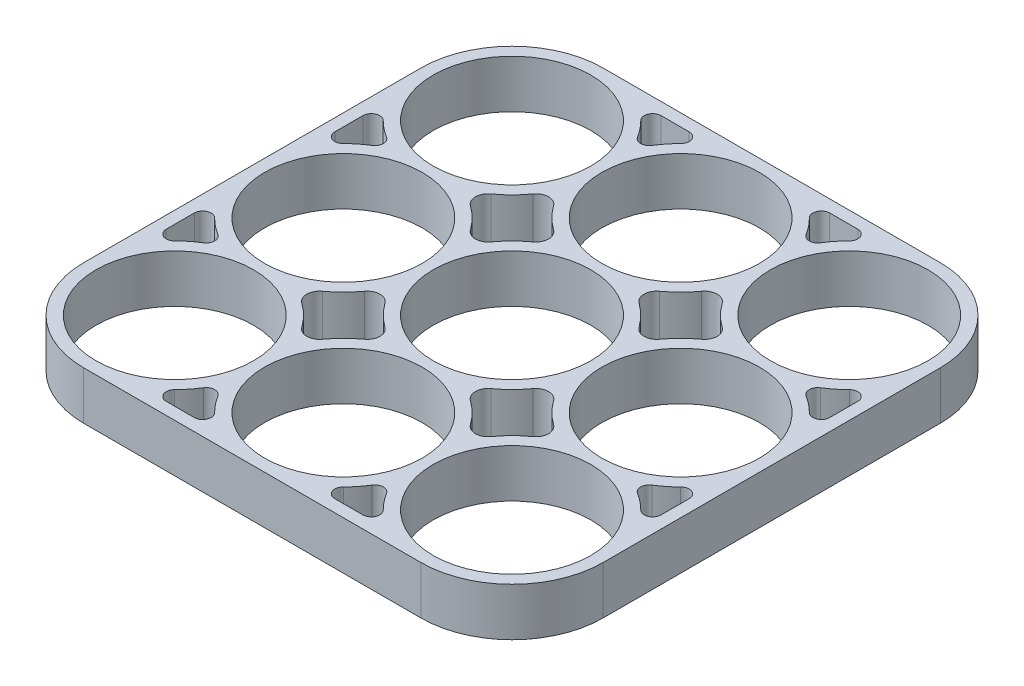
from build123d import *

# Parameters (mm, degrees)
SKIZZE1_R                       = 9.35
AUFSATZ_LINEAR_AUSTRAGEN1_DEPTH = 5.7


with BuildPart() as part:
    # Skizze1 → Aufsatz-Linear austragen1 (new body)
    with BuildSketch(Plane(origin=(0, 0, 0), x_dir=(1, 0, 0), z_dir=(0, 1, 0))):
        with BuildLine():
            Line((-30.8, 20), (-30.8, -20))
            ThreePointArc((-30.8, -20), (-27.636753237, -27.636753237), (-20, -30.8))
            Line((-20, -30.8), (20, -30.8))
            ThreePointArc((20, -30.8), (27.636753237, -27.636753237), (30.8, -20))
            Line((30.8, -20), (30.8, 20))
            ThreePointArc((30.8, 20), (27.636753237, 27.636753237), (20, 30.8))
            Line((20, 30.8), (-20, 30.8))
            ThreePointArc((-20, 30.8), (-27.636753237, 27.636753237), (-30.8, 20))
        make_face()
        with Locations(Location((-20, 20, 0), (0, 0, 270))):
            Circle(SKIZZE1_R, mode=Mode.SUBTRACT)
        with Locations(Location((-20, 0, 0), (0, 0, 270))):
            Circle(SKIZZE1_R, mode=Mode.SUBTRACT)
        with Locations(Location((-20, -20, 0), (0, 0, 270))):
            Circle(SKIZZE1_R, mode=Mode.SUBTRACT)
        with Locations(Location((0, -20, 0), (0, 0, 270))):
            Circle(SKIZZE1_R, mode=Mode.SUBTRACT)
        with Locations(Location((0, 0, 0), (0, 0, 270))):
            Circle(SKIZZE1_R, mode=Mode.SUBTRACT)
        with Locations(Location((0, 20, 0), (0, 0, 270))):
            Circle(SKIZZE1_R, mode=Mode.SUBTRACT)
        with Locations(Location((20, 20, 0), (0, 0, 270))):
            Circle(SKIZZE1_R, mode=Mode.SUBTRACT)
        with Locations(Location((20, 0, 0), (0, 0, 270))):
            Circle(SKIZZE1_R, mode=Mode.SUBTRACT)
        with Locations(Location((20, -20, 0), (0, 0, 270))):
            Circle(SKIZZE1_R, mode=Mode.SUBTRACT)
        with BuildLine():
            Line((-29.35, 11.662284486), (-29.35, 8.337715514))
            ThreePointArc((-29.35, 8.337715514), (-28.732343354, 7.41369519), (-27.642372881, 7.631129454))
            ThreePointArc((-27.642372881, 7.631129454), (-26.730970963, 8.445947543), (-25.733320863, 9.152542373))
            ThreePointArc((-25.733320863, 9.152542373), (-25.264183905, 10), (-25.733320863, 10.847457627))
            ThreePointArc((-25.733320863, 10.847457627), (-26.730970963, 11.554052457), (-27.642372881, 12.368870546))
            ThreePointArc((-27.642372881, 12.368870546), (-28.732343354, 12.58630481), (-29.35, 11.662284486))
        make_face(mode=Mode.SUBTRACT)
        with BuildLine():
            Line((-29.35, -8.337715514), (-29.35, -11.662284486))
            ThreePointArc((-29.35, -11.662284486), (-28.732343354, -12.58630481), (-27.642372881, -12.368870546))
            ThreePointArc((-27.642372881, -12.368870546), (-26.730970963, -11.554052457), (-25.733320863, -10.847457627))
            ThreePointArc((-25.733320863, -10.847457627), (-25.264183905, -10), (-25.733320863, -9.152542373))
            ThreePointArc((-25.733320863, -9.152542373), (-26.730970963, -8.445947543), (-27.642372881, -7.631129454))
            ThreePointArc((-27.642372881, -7.631129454), (-28.732343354, -7.41369519), (-29.35, -8.337715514))
        make_face(mode=Mode.SUBTRACT)
        with BuildLine():
            Line((-11.662284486, -29.35), (-8.337715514, -29.35))
            ThreePointArc((-8.337715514, -29.35), (-7.41369519, -28.732343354), (-7.631129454, -27.642372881))
            ThreePointArc((-7.631129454, -27.642372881), (-8.445947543, -26.730970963), (-9.152542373, -25.733320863))
            ThreePointArc((-9.152542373, -25.733320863), (-10, -25.264183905), (-10.847457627, -25.733320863))
            ThreePointArc((-10.847457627, -25.733320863), (-11.554052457, -26.730970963), (-12.368870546, -27.642372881))
            ThreePointArc((-12.368870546, -27.642372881), (-12.58630481, -28.732343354), (-11.662284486, -29.35))
        make_face(mode=Mode.SUBTRACT)
        with BuildLine():
            Line((8.337715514, -29.35), (11.662284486, -29.35))
            ThreePointArc((11.662284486, -29.35), (12.58630481, -28.732343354), (12.368870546, -27.642372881))
            ThreePointArc((12.368870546, -27.642372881), (11.554052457, -26.730970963), (10.847457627, -25.733320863))
            ThreePointArc((10.847457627, -25.733320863), (10, -25.264183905), (9.152542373, -25.733320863))
            ThreePointArc((9.152542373, -25.733320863), (8.445947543, -26.730970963), (7.631129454, -27.642372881))
            ThreePointArc((7.631129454, -27.642372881), (7.41369519, -28.732343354), (8.337715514, -29.35))
        make_face(mode=Mode.SUBTRACT)
        with BuildLine():
            Line((-11.662284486, 29.35), (-8.337715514, 29.35))
            ThreePointArc((-8.337715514, 29.35), (-7.41369519, 28.732343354), (-7.631129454, 27.642372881))
            ThreePointArc((-7.631129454, 27.642372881), (-8.445947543, 26.730970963), (-9.152542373, 25.733320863))
            ThreePointArc((-9.152542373, 25.733320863), (-10, 25.264183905), (-10.847457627, 25.733320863))
            ThreePointArc((-10.847457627, 25.733320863), (-11.554052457, 26.730970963), (-12.368870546, 27.642372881))
            ThreePointArc((-12.368870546, 27.642372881), (-12.58630481, 28.732343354), (-11.662284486, 29.35))
        make_face(mode=Mode.SUBTRACT)
        with BuildLine():
            Line((8.337715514, 29.35), (11.662284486, 29.35))
            ThreePointArc((11.662284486, 29.35), (12.58630481, 28.732343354), (12.368870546, 27.642372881))
            ThreePointArc((12.368870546, 27.642372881), (11.554052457, 26.730970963), (10.847457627, 25.733320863))
            ThreePointArc((10.847457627, 25.733320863), (10, 25.264183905), (9.152542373, 25.733320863))
            ThreePointArc((9.152542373, 25.733320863), (8.445947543, 26.730970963), (7.631129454, 27.642372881))
            ThreePointArc((7.631129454, 27.642372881), (7.41369519, 28.732343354), (8.337715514, 29.35))
        make_face(mode=Mode.SUBTRACT)
        with BuildLine():
            Line((29.35, -11.662284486), (29.35, -8.337715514))
            ThreePointArc((29.35, -8.337715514), (28.732343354, -7.41369519), (27.642372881, -7.631129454))
            ThreePointArc((27.642372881, -7.631129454), (26.730970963, -8.445947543), (25.733320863, -9.152542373))
            ThreePointArc((25.733320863, -9.152542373), (25.264183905, -10), (25.733320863, -10.847457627))
            ThreePointArc((25.733320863, -10.847457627), (26.730970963, -11.554052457), (27.642372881, -12.368870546))
            ThreePointArc((27.642372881, -12.368870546), (28.732343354, -12.58630481), (29.35, -11.662284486))
        make_face(mode=Mode.SUBTRACT)
        with BuildLine():
            Line((29.35, 8.337715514), (29.35, 11.662284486))
            ThreePointArc((29.35, 11.662284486), (28.732343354, 12.58630481), (27.642372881, 12.368870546))
            ThreePointArc((27.642372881, 12.368870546), (26.730970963, 11.554052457), (25.733320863, 10.847457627))
            ThreePointArc((25.733320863, 10.847457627), (25.264183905, 10), (25.733320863, 9.152542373))
            ThreePointArc((25.733320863, 9.152542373), (26.730970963, 8.445947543), (27.642372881, 7.631129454))
            ThreePointArc((27.642372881, 7.631129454), (28.732343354, 7.41369519), (29.35, 8.337715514))
        make_face(mode=Mode.SUBTRACT)
        with BuildLine():
            ThreePointArc((-13.711674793, -8.780487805), (-12.363246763, -7.636753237), (-11.219512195, -6.288325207))
            ThreePointArc((-11.219512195, -6.288325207), (-10, -5.661703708), (-8.780487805, -6.288325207))
            ThreePointArc((-8.780487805, -6.288325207), (-7.636753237, -7.636753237), (-6.288325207, -8.780487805))
            ThreePointArc((-6.288325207, -8.780487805), (-5.661703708, -10), (-6.288325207, -11.219512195))
            ThreePointArc((-6.288325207, -11.219512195), (-7.636753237, -12.363246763), (-8.780487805, -13.711674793))
            ThreePointArc((-8.780487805, -13.711674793), (-10, -14.338296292), (-11.219512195, -13.711674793))
            ThreePointArc((-11.219512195, -13.711674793), (-12.363246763, -12.363246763), (-13.711674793, -11.219512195))
            ThreePointArc((-13.711674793, -11.219512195), (-14.338296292, -10), (-13.711674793, -8.780487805))
        make_face(mode=Mode.SUBTRACT)
        with BuildLine():
            ThreePointArc((6.288325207, 11.219512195), (7.636753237, 12.363246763), (8.780487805, 13.711674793))
            ThreePointArc((8.780487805, 13.711674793), (10, 14.338296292), (11.219512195, 13.711674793))
            ThreePointArc((11.219512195, 13.711674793), (12.363246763, 12.363246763), (13.711674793, 11.219512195))
            ThreePointArc((13.711674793, 11.219512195), (14.338296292, 10), (13.711674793, 8.780487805))
            ThreePointArc((13.711674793, 8.780487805), (12.363246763, 7.636753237), (11.219512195, 6.288325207))
            ThreePointArc((11.219512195, 6.288325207), (10, 5.661703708), (8.780487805, 6.288325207))
            ThreePointArc((8.780487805, 6.288325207), (7.636753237, 7.636753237), (6.288325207, 8.780487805))
            ThreePointArc((6.288325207, 8.780487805), (5.661703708, 10), (6.288325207, 11.219512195))
        make_face(mode=Mode.SUBTRACT)
        with BuildLine():
            ThreePointArc((6.288325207, -8.780487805), (7.636753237, -7.636753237), (8.780487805, -6.288325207))
            ThreePointArc((8.780487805, -6.288325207), (10, -5.661703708), (11.219512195, -6.288325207))
            ThreePointArc((11.219512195, -6.288325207), (12.363246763, -7.636753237), (13.711674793, -8.780487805))
            ThreePointArc((13.711674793, -8.780487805), (14.338296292, -10), (13.711674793, -11.219512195))
            ThreePointArc((13.711674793, -11.219512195), (12.363246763, -12.363246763), (11.219512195, -13.711674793))
            ThreePointArc((11.219512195, -13.711674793), (10, -14.338296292), (8.780487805, -13.711674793))
            ThreePointArc((8.780487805, -13.711674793), (7.636753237, -12.363246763), (6.288325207, -11.219512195))
            ThreePointArc((6.288325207, -11.219512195), (5.661703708, -10), (6.288325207, -8.780487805))
        make_face(mode=Mode.SUBTRACT)
        with BuildLine():
            ThreePointArc((-13.711674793, 11.219512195), (-12.363246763, 12.363246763), (-11.219512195, 13.711674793))
            ThreePointArc((-11.219512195, 13.711674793), (-10, 14.338296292), (-8.780487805, 13.711674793))
            ThreePointArc((-8.780487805, 13.711674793), (-7.636753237, 12.363246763), (-6.288325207, 11.219512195))
            ThreePointArc((-6.288325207, 11.219512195), (-5.661703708, 10), (-6.288325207, 8.780487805))
            ThreePointArc((-6.288325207, 8.780487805), (-7.636753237, 7.636753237), (-8.780487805, 6.288325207))
            ThreePointArc((-8.780487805, 6.288325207), (-10, 5.661703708), (-11.219512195, 6.288325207))
            ThreePointArc((-11.219512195, 6.288325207), (-12.363246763, 7.636753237), (-13.711674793, 8.780487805))
            ThreePointArc((-13.711674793, 8.780487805), (-14.338296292, 10), (-13.711674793, 11.219512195))
        make_face(mode=Mode.SUBTRACT)
    extrude(amount=AUFSATZ_LINEAR_AUSTRAGEN1_DEPTH)


solid = part.part
